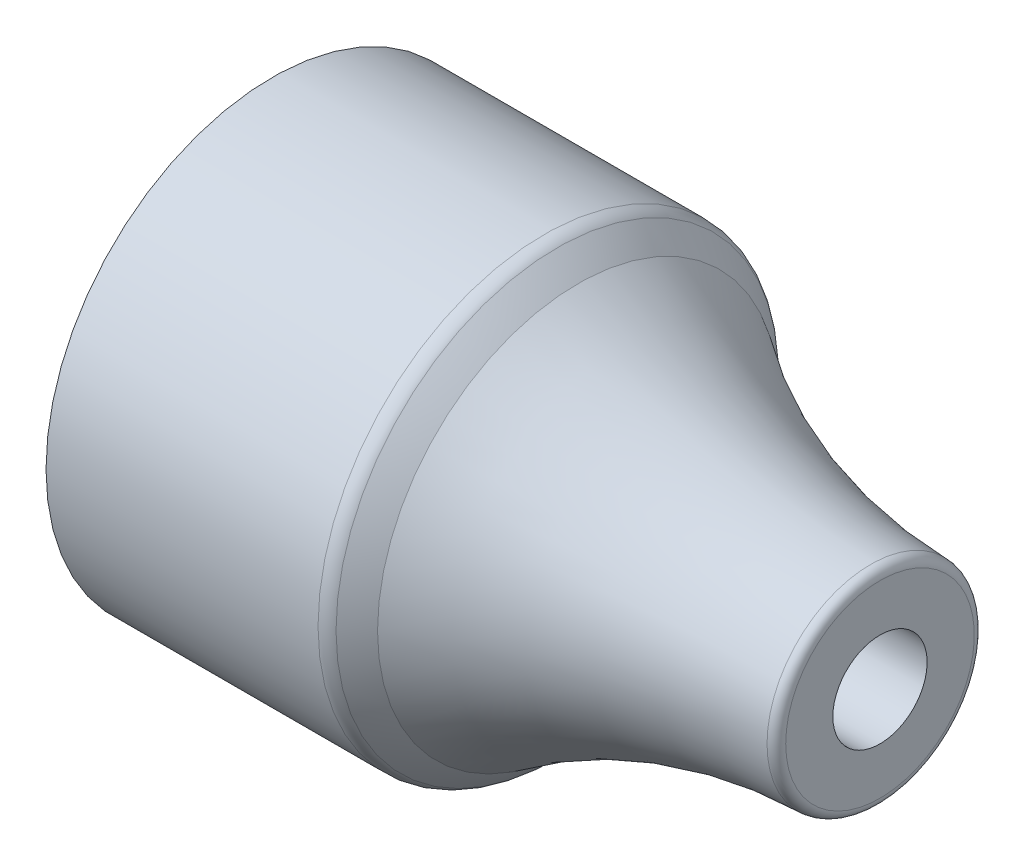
ISO-10303-21;
HEADER;
FILE_DESCRIPTION(('STEP AP214'),'2;1');
FILE_NAME('part.step','',(''),(''),'','','');
FILE_SCHEMA(('AUTOMOTIVE_DESIGN { 1 0 10303 214 1 1 1 1 }'));
ENDSEC;
DATA;
#1=APPLICATION_CONTEXT('core data for automotive mechanical design processes');
#2=APPLICATION_PROTOCOL_DEFINITION('international standard','automotive_design',2000,#1);
#3=PRODUCT_CONTEXT('',#1,'mechanical');
#4=PRODUCT('Part','Part','',(#3));
#5=PRODUCT_RELATED_PRODUCT_CATEGORY('part','',(#4));
#6=PRODUCT_DEFINITION_FORMATION('','',#4);
#7=PRODUCT_DEFINITION_CONTEXT('part definition',#1,'design');
#8=PRODUCT_DEFINITION('design','',#6,#7);
#9=PRODUCT_DEFINITION_SHAPE('','',#8);
#10=(LENGTH_UNIT() NAMED_UNIT(*) SI_UNIT(.MILLI.,.METRE.));
#11=(NAMED_UNIT(*) PLANE_ANGLE_UNIT() SI_UNIT($,.RADIAN.));
#12=(NAMED_UNIT(*) SI_UNIT($,.STERADIAN.) SOLID_ANGLE_UNIT());
#13=UNCERTAINTY_MEASURE_WITH_UNIT(LENGTH_MEASURE(1.E-05),#10,'distance_accuracy_value','');
#14=(GEOMETRIC_REPRESENTATION_CONTEXT(3) GLOBAL_UNCERTAINTY_ASSIGNED_CONTEXT((#13)) GLOBAL_UNIT_ASSIGNED_CONTEXT((#10,
#11,#12)) REPRESENTATION_CONTEXT('',''));
#15=CARTESIAN_POINT('',(0.,0.,0.));
#16=DIRECTION('',(0.,0.,1.));
#17=DIRECTION('',(1.,0.,0.));
#18=AXIS2_PLACEMENT_3D('',#15,#16,#17);
#19=CARTESIAN_POINT('',(-1.,6.,0.));
#20=DIRECTION('',(1.,0.,0.));
#21=DIRECTION('',(0.,0.,-1.));
#22=AXIS2_PLACEMENT_3D('',#19,#20,#21);
#23=PLANE('',#22);
#24=CARTESIAN_POINT('',(-1.,0.,0.));
#25=DIRECTION('',(-1.,0.,0.));
#26=DIRECTION('',(0.,0.,1.));
#27=AXIS2_PLACEMENT_3D('',#24,#25,#26);
#28=CIRCLE('',#27,6.);
#29=CARTESIAN_POINT('',(-1.,0.,6.));
#30=VERTEX_POINT('',#29);
#31=EDGE_CURVE('E78',#30,#30,#28,.T.);
#32=ORIENTED_EDGE('',*,*,#31,.T.);
#33=EDGE_LOOP('',(#32));
#34=FACE_BOUND('',#33,.T.);
#35=CARTESIAN_POINT('',(-1.,0.,0.));
#36=DIRECTION('',(1.,0.,0.));
#37=DIRECTION('',(0.,0.,-1.));
#38=AXIS2_PLACEMENT_3D('',#35,#36,#37);
#39=CIRCLE('',#38,4.);
#40=CARTESIAN_POINT('',(-1.,0.,-4.));
#41=VERTEX_POINT('',#40);
#42=EDGE_CURVE('E10',#41,#41,#39,.F.);
#43=ORIENTED_EDGE('',*,*,#42,.F.);
#44=EDGE_LOOP('',(#43));
#45=FACE_BOUND('',#44,.T.);
#46=ADVANCED_FACE('F34',(#34,#45),#23,.F.);
#47=CARTESIAN_POINT('',(-25.6027488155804,0.,0.));
#48=DIRECTION('',(-1.,0.,0.));
#49=DIRECTION('',(0.,0.,1.));
#50=AXIS2_PLACEMENT_3D('',#47,#48,#49);
#51=TOROIDAL_SURFACE('',#50,22.,2.);
#52=CARTESIAN_POINT('',(-25.6027488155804,0.,0.));
#53=DIRECTION('',(-1.,0.,0.));
#54=DIRECTION('',(0.,0.,1.));
#55=AXIS2_PLACEMENT_3D('',#52,#53,#54);
#56=CIRCLE('',#55,24.);
#57=CARTESIAN_POINT('',(-25.6027488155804,0.,24.));
#58=VERTEX_POINT('',#57);
#59=EDGE_CURVE('E41',#58,#58,#56,.T.);
#60=ORIENTED_EDGE('',*,*,#59,.F.);
#61=EDGE_LOOP('',(#60));
#62=FACE_BOUND('',#61,.T.);
#63=CARTESIAN_POINT('',(-24.235336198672,0.,0.));
#64=DIRECTION('',(-1.,0.,0.));
#65=DIRECTION('',(0.,0.,1.));
#66=AXIS2_PLACEMENT_3D('',#63,#64,#65);
#67=CIRCLE('',#66,23.4595145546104);
#68=CARTESIAN_POINT('',(-24.235336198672,0.,23.4595145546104));
#69=VERTEX_POINT('',#68);
#70=EDGE_CURVE('E96',#69,#69,#67,.T.);
#71=ORIENTED_EDGE('',*,*,#70,.T.);
#72=EDGE_LOOP('',(#71));
#73=FACE_BOUND('',#72,.T.);
#74=ADVANCED_FACE('F36',(#62,#73),#51,.T.);
#75=CARTESIAN_POINT('',(-71.7746086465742,0.,0.));
#76=DIRECTION('',(-1.,0.,0.));
#77=DIRECTION('',(0.,0.,1.));
#78=AXIS2_PLACEMENT_3D('',#75,#76,#77);
#79=CYLINDRICAL_SURFACE('',#78,24.);
#80=CARTESIAN_POINT('',(-54.45,0.,0.));
#81=DIRECTION('',(-1.,0.,0.));
#82=DIRECTION('',(0.,0.,1.));
#83=AXIS2_PLACEMENT_3D('',#80,#81,#82);
#84=CIRCLE('',#83,24.);
#85=CARTESIAN_POINT('',(-54.45,0.,24.));
#86=VERTEX_POINT('',#85);
#87=EDGE_CURVE('E45',#86,#86,#84,.T.);
#88=ORIENTED_EDGE('',*,*,#87,.F.);
#89=EDGE_LOOP('',(#88));
#90=FACE_BOUND('',#89,.T.);
#91=ORIENTED_EDGE('',*,*,#59,.T.);
#92=EDGE_LOOP('',(#91));
#93=FACE_BOUND('',#92,.T.);
#94=ADVANCED_FACE('F131',(#90,#93),#79,.T.);
#95=CARTESIAN_POINT('',(-54.45,24.,0.));
#96=DIRECTION('',(1.,0.,0.));
#97=DIRECTION('',(0.,0.,-1.));
#98=AXIS2_PLACEMENT_3D('',#95,#96,#97);
#99=PLANE('',#98);
#100=CARTESIAN_POINT('',(-54.45,0.,0.));
#101=DIRECTION('',(-1.,0.,0.));
#102=DIRECTION('',(0.,0.,1.));
#103=AXIS2_PLACEMENT_3D('',#100,#101,#102);
#104=CIRCLE('',#103,23.5);
#105=CARTESIAN_POINT('',(-54.45,0.,23.5));
#106=VERTEX_POINT('',#105);
#107=EDGE_CURVE('E49',#106,#106,#104,.T.);
#108=ORIENTED_EDGE('',*,*,#107,.F.);
#109=EDGE_LOOP('',(#108));
#110=FACE_BOUND('',#109,.T.);
#111=ORIENTED_EDGE('',*,*,#87,.T.);
#112=EDGE_LOOP('',(#111));
#113=FACE_BOUND('',#112,.T.);
#114=ADVANCED_FACE('F173',(#110,#113),#99,.F.);
#115=CARTESIAN_POINT('',(-71.7746086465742,0.,0.));
#116=DIRECTION('',(-1.,0.,0.));
#117=DIRECTION('',(0.,0.,1.));
#118=AXIS2_PLACEMENT_3D('',#115,#116,#117);
#119=CYLINDRICAL_SURFACE('',#118,23.5);
#120=CARTESIAN_POINT('',(-51.45,0.,0.));
#121=DIRECTION('',(-1.,0.,0.));
#122=DIRECTION('',(0.,0.,1.));
#123=AXIS2_PLACEMENT_3D('',#120,#121,#122);
#124=CIRCLE('',#123,23.5);
#125=CARTESIAN_POINT('',(-51.45,0.,23.5));
#126=VERTEX_POINT('',#125);
#127=EDGE_CURVE('E54',#126,#126,#124,.T.);
#128=ORIENTED_EDGE('',*,*,#127,.F.);
#129=EDGE_LOOP('',(#128));
#130=FACE_BOUND('',#129,.T.);
#131=ORIENTED_EDGE('',*,*,#107,.T.);
#132=EDGE_LOOP('',(#131));
#133=FACE_BOUND('',#132,.T.);
#134=ADVANCED_FACE('F169',(#130,#133),#119,.F.);
#135=CARTESIAN_POINT('',(-51.45,23.5,0.));
#136=DIRECTION('',(1.,0.,0.));
#137=DIRECTION('',(0.,0.,-1.));
#138=AXIS2_PLACEMENT_3D('',#135,#136,#137);
#139=PLANE('',#138);
#140=CARTESIAN_POINT('',(-51.45,0.,0.));
#141=DIRECTION('',(-1.,0.,0.));
#142=DIRECTION('',(0.,0.,1.));
#143=AXIS2_PLACEMENT_3D('',#140,#141,#142);
#144=CIRCLE('',#143,23.);
#145=CARTESIAN_POINT('',(-51.45,0.,23.));
#146=VERTEX_POINT('',#145);
#147=EDGE_CURVE('E57',#146,#146,#144,.T.);
#148=ORIENTED_EDGE('',*,*,#147,.F.);
#149=EDGE_LOOP('',(#148));
#150=FACE_BOUND('',#149,.T.);
#151=ORIENTED_EDGE('',*,*,#127,.T.);
#152=EDGE_LOOP('',(#151));
#153=FACE_BOUND('',#152,.T.);
#154=ADVANCED_FACE('F165',(#150,#153),#139,.F.);
#155=CARTESIAN_POINT('',(-71.7746086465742,0.,0.));
#156=DIRECTION('',(-1.,0.,0.));
#157=DIRECTION('',(0.,0.,1.));
#158=AXIS2_PLACEMENT_3D('',#155,#156,#157);
#159=CYLINDRICAL_SURFACE('',#158,23.);
#160=CARTESIAN_POINT('',(-26.,0.,0.));
#161=DIRECTION('',(-1.,0.,0.));
#162=DIRECTION('',(0.,0.,1.));
#163=AXIS2_PLACEMENT_3D('',#160,#161,#162);
#164=CIRCLE('',#163,23.);
#165=CARTESIAN_POINT('',(-26.,0.,23.));
#166=VERTEX_POINT('',#165);
#167=EDGE_CURVE('E60',#166,#166,#164,.T.);
#168=ORIENTED_EDGE('',*,*,#167,.F.);
#169=EDGE_LOOP('',(#168));
#170=FACE_BOUND('',#169,.T.);
#171=ORIENTED_EDGE('',*,*,#147,.T.);
#172=EDGE_LOOP('',(#171));
#173=FACE_BOUND('',#172,.T.);
#174=ADVANCED_FACE('F161',(#170,#173),#159,.F.);
#175=CARTESIAN_POINT('',(-26.,0.,0.));
#176=DIRECTION('',(-1.,0.,0.));
#177=DIRECTION('',(0.,0.,1.));
#178=AXIS2_PLACEMENT_3D('',#175,#176,#177);
#179=TOROIDAL_SURFACE('',#178,21.,2.);
#180=CARTESIAN_POINT('',(-24.6225363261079,0.,0.));
#181=DIRECTION('',(-1.,0.,0.));
#182=DIRECTION('',(0.,0.,1.));
#183=AXIS2_PLACEMENT_3D('',#180,#181,#182);
#184=CIRCLE('',#183,22.4500323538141);
#185=CARTESIAN_POINT('',(-24.6225363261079,0.,22.4500323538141));
#186=VERTEX_POINT('',#185);
#187=EDGE_CURVE('E63',#186,#186,#184,.T.);
#188=ORIENTED_EDGE('',*,*,#187,.F.);
#189=EDGE_LOOP('',(#188));
#190=FACE_BOUND('',#189,.T.);
#191=ORIENTED_EDGE('',*,*,#167,.T.);
#192=EDGE_LOOP('',(#191));
#193=FACE_BOUND('',#192,.T.);
#194=ADVANCED_FACE('F157',(#190,#193),#179,.F.);
#195=CARTESIAN_POINT('',(-65.2577147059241,0.,0.));
#196=DIRECTION('',(-1.,0.,0.));
#197=DIRECTION('',(0.,0.,1.));
#198=AXIS2_PLACEMENT_3D('',#195,#196,#197);
#199=DEGENERATE_TOROIDAL_SURFACE('',#198,20.3259220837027,59.,.F.);
#200=CARTESIAN_POINT('',(-22.6764290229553,0.,0.));
#201=DIRECTION('',(-1.,0.,0.));
#202=DIRECTION('',(0.,0.,1.));
#203=AXIS2_PLACEMENT_3D('',#200,#201,#202);
#204=CIRCLE('',#203,20.5132026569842);
#205=CARTESIAN_POINT('',(-22.6764290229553,0.,20.5132026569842));
#206=VERTEX_POINT('',#205);
#207=EDGE_CURVE('E66',#206,#206,#204,.T.);
#208=ORIENTED_EDGE('',*,*,#207,.F.);
#209=EDGE_LOOP('',(#208));
#210=FACE_BOUND('',#209,.T.);
#211=ORIENTED_EDGE('',*,*,#187,.T.);
#212=EDGE_LOOP('',(#211));
#213=FACE_BOUND('',#212,.T.);
#214=ADVANCED_FACE('F153',(#210,#213),#199,.T.);
#215=CARTESIAN_POINT('',(10.,0.,0.));
#216=DIRECTION('',(-1.,0.,0.));
#217=DIRECTION('',(0.,0.,1.));
#218=AXIS2_PLACEMENT_3D('',#215,#216,#217);
#219=TOROIDAL_SURFACE('',#218,65.9912301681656,56.);
#220=CARTESIAN_POINT('',(8.03508771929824,0.,0.));
#221=DIRECTION('',(-1.,0.,0.));
#222=DIRECTION('',(0.,0.,1.));
#223=AXIS2_PLACEMENT_3D('',#220,#221,#222);
#224=CIRCLE('',#223,10.0257129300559);
#225=CARTESIAN_POINT('',(8.03508771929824,0.,10.0257129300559));
#226=VERTEX_POINT('',#225);
#227=EDGE_CURVE('E69',#226,#226,#224,.T.);
#228=ORIENTED_EDGE('',*,*,#227,.F.);
#229=EDGE_LOOP('',(#228));
#230=FACE_BOUND('',#229,.T.);
#231=ORIENTED_EDGE('',*,*,#207,.T.);
#232=EDGE_LOOP('',(#231));
#233=FACE_BOUND('',#232,.T.);
#234=ADVANCED_FACE('F149',(#230,#233),#219,.T.);
#235=CARTESIAN_POINT('',(8.,0.,0.));
#236=DIRECTION('',(-1.,0.,0.));
#237=DIRECTION('',(0.,0.,1.));
#238=AXIS2_PLACEMENT_3D('',#235,#236,#237);
#239=TOROIDAL_SURFACE('',#238,9.02632869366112,1.);
#240=CARTESIAN_POINT('',(9.00000000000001,0.,0.));
#241=DIRECTION('',(-1.,0.,0.));
#242=DIRECTION('',(0.,0.,1.));
#243=AXIS2_PLACEMENT_3D('',#240,#241,#242);
#244=CIRCLE('',#243,9.02632869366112);
#245=CARTESIAN_POINT('',(9.00000000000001,0.,9.02632869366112));
#246=VERTEX_POINT('',#245);
#247=EDGE_CURVE('E72',#246,#246,#244,.T.);
#248=ORIENTED_EDGE('',*,*,#247,.F.);
#249=EDGE_LOOP('',(#248));
#250=FACE_BOUND('',#249,.T.);
#251=ORIENTED_EDGE('',*,*,#227,.T.);
#252=EDGE_LOOP('',(#251));
#253=FACE_BOUND('',#252,.T.);
#254=ADVANCED_FACE('F145',(#250,#253),#239,.F.);
#255=CARTESIAN_POINT('',(9.,6.,0.));
#256=DIRECTION('',(1.,0.,0.));
#257=DIRECTION('',(0.,0.,-1.));
#258=AXIS2_PLACEMENT_3D('',#255,#256,#257);
#259=PLANE('',#258);
#260=CARTESIAN_POINT('',(9.00000000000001,0.,0.));
#261=DIRECTION('',(-1.,0.,0.));
#262=DIRECTION('',(0.,0.,1.));
#263=AXIS2_PLACEMENT_3D('',#260,#261,#262);
#264=CIRCLE('',#263,6.);
#265=CARTESIAN_POINT('',(9.00000000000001,0.,6.));
#266=VERTEX_POINT('',#265);
#267=EDGE_CURVE('E75',#266,#266,#264,.T.);
#268=ORIENTED_EDGE('',*,*,#267,.F.);
#269=EDGE_LOOP('',(#268));
#270=FACE_BOUND('',#269,.T.);
#271=ORIENTED_EDGE('',*,*,#247,.T.);
#272=EDGE_LOOP('',(#271));
#273=FACE_BOUND('',#272,.T.);
#274=ADVANCED_FACE('F141',(#270,#273),#259,.F.);
#275=CARTESIAN_POINT('',(-71.7746086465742,0.,0.));
#276=DIRECTION('',(-1.,0.,0.));
#277=DIRECTION('',(0.,0.,1.));
#278=AXIS2_PLACEMENT_3D('',#275,#276,#277);
#279=CYLINDRICAL_SURFACE('',#278,6.);
#280=ORIENTED_EDGE('',*,*,#31,.F.);
#281=EDGE_LOOP('',(#280));
#282=FACE_BOUND('',#281,.T.);
#283=ORIENTED_EDGE('',*,*,#267,.T.);
#284=EDGE_LOOP('',(#283));
#285=FACE_BOUND('',#284,.T.);
#286=ADVANCED_FACE('F138',(#282,#285),#279,.T.);
#287=CARTESIAN_POINT('',(0.,0.,0.));
#288=DIRECTION('',(-1.,0.,0.));
#289=DIRECTION('',(0.,0.,1.));
#290=AXIS2_PLACEMENT_3D('',#287,#288,#289);
#291=PLANE('',#290);
#292=CARTESIAN_POINT('',(0.,0.,0.));
#293=DIRECTION('',(1.,0.,0.));
#294=DIRECTION('',(0.,0.,-1.));
#295=AXIS2_PLACEMENT_3D('',#292,#293,#294);
#296=CIRCLE('',#295,3.);
#297=CARTESIAN_POINT('',(0.,0.,-3.));
#298=VERTEX_POINT('',#297);
#299=EDGE_CURVE('E99',#298,#298,#296,.T.);
#300=ORIENTED_EDGE('',*,*,#299,.F.);
#301=EDGE_LOOP('',(#300));
#302=FACE_BOUND('',#301,.T.);
#303=CARTESIAN_POINT('',(0.,0.,0.));
#304=DIRECTION('',(-1.,0.,0.));
#305=DIRECTION('',(0.,0.,1.));
#306=AXIS2_PLACEMENT_3D('',#303,#304,#305);
#307=CIRCLE('',#306,5.);
#308=CARTESIAN_POINT('',(0.,0.,5.));
#309=VERTEX_POINT('',#308);
#310=EDGE_CURVE('E81',#309,#309,#307,.T.);
#311=ORIENTED_EDGE('',*,*,#310,.F.);
#312=EDGE_LOOP('',(#311));
#313=FACE_BOUND('',#312,.T.);
#314=ADVANCED_FACE('F136',(#302,#313),#291,.F.);
#315=CARTESIAN_POINT('',(-71.7746086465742,0.,0.));
#316=DIRECTION('',(-1.,0.,0.));
#317=DIRECTION('',(0.,0.,1.));
#318=AXIS2_PLACEMENT_3D('',#315,#316,#317);
#319=CYLINDRICAL_SURFACE('',#318,5.);
#320=CARTESIAN_POINT('',(9.99999999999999,0.,0.));
#321=DIRECTION('',(-1.,0.,0.));
#322=DIRECTION('',(0.,0.,1.));
#323=AXIS2_PLACEMENT_3D('',#320,#321,#322);
#324=CIRCLE('',#323,5.);
#325=CARTESIAN_POINT('',(9.99999999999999,0.,5.));
#326=VERTEX_POINT('',#325);
#327=EDGE_CURVE('E84',#326,#326,#324,.T.);
#328=ORIENTED_EDGE('',*,*,#327,.F.);
#329=EDGE_LOOP('',(#328));
#330=FACE_BOUND('',#329,.T.);
#331=ORIENTED_EDGE('',*,*,#310,.T.);
#332=EDGE_LOOP('',(#331));
#333=FACE_BOUND('',#332,.T.);
#334=ADVANCED_FACE('F233',(#330,#333),#319,.F.);
#335=CARTESIAN_POINT('',(10.,5.,0.));
#336=DIRECTION('',(-1.,0.,0.));
#337=DIRECTION('',(0.,0.,1.));
#338=AXIS2_PLACEMENT_3D('',#335,#336,#337);
#339=PLANE('',#338);
#340=CARTESIAN_POINT('',(10.,0.,0.));
#341=DIRECTION('',(-1.,0.,0.));
#342=DIRECTION('',(0.,0.,1.));
#343=AXIS2_PLACEMENT_3D('',#340,#341,#342);
#344=CIRCLE('',#343,10.0001594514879);
#345=CARTESIAN_POINT('',(10.,0.,10.0001594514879));
#346=VERTEX_POINT('',#345);
#347=EDGE_CURVE('E87',#346,#346,#344,.T.);
#348=ORIENTED_EDGE('',*,*,#347,.F.);
#349=EDGE_LOOP('',(#348));
#350=FACE_BOUND('',#349,.T.);
#351=ORIENTED_EDGE('',*,*,#327,.T.);
#352=EDGE_LOOP('',(#351));
#353=FACE_BOUND('',#352,.T.);
#354=ADVANCED_FACE('F240',(#350,#353),#339,.F.);
#355=CARTESIAN_POINT('',(9.,0.,0.));
#356=DIRECTION('',(-1.,0.,0.));
#357=DIRECTION('',(0.,0.,1.));
#358=AXIS2_PLACEMENT_3D('',#355,#356,#357);
#359=TOROIDAL_SURFACE('',#358,10.0001594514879,1.);
#360=CARTESIAN_POINT('',(9.01785714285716,0.,0.));
#361=DIRECTION('',(-1.,0.,0.));
#362=DIRECTION('',(0.,0.,1.));
#363=AXIS2_PLACEMENT_3D('',#360,#361,#362);
#364=CIRCLE('',#363,11.);
#365=CARTESIAN_POINT('',(9.01785714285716,0.,11.));
#366=VERTEX_POINT('',#365);
#367=EDGE_CURVE('E90',#366,#366,#364,.T.);
#368=ORIENTED_EDGE('',*,*,#367,.F.);
#369=EDGE_LOOP('',(#368));
#370=FACE_BOUND('',#369,.T.);
#371=ORIENTED_EDGE('',*,*,#347,.T.);
#372=EDGE_LOOP('',(#371));
#373=FACE_BOUND('',#372,.T.);
#374=ADVANCED_FACE('F247',(#370,#373),#359,.T.);
#375=CARTESIAN_POINT('',(10.,0.,0.));
#376=DIRECTION('',(-1.,0.,0.));
#377=DIRECTION('',(0.,0.,1.));
#378=AXIS2_PLACEMENT_3D('',#375,#376,#377);
#379=TOROIDAL_SURFACE('',#378,65.9912301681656,55.);
#380=CARTESIAN_POINT('',(-22.0189134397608,0.,0.));
#381=DIRECTION('',(-1.,0.,0.));
#382=DIRECTION('',(0.,0.,1.));
#383=AXIS2_PLACEMENT_3D('',#380,#381,#382);
#384=CIRCLE('',#383,21.2722276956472);
#385=CARTESIAN_POINT('',(-22.0189134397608,0.,21.2722276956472));
#386=VERTEX_POINT('',#385);
#387=EDGE_CURVE('E93',#386,#386,#384,.T.);
#388=ORIENTED_EDGE('',*,*,#387,.F.);
#389=EDGE_LOOP('',(#388));
#390=FACE_BOUND('',#389,.T.);
#391=ORIENTED_EDGE('',*,*,#367,.T.);
#392=EDGE_LOOP('',(#391));
#393=FACE_BOUND('',#392,.T.);
#394=ADVANCED_FACE('F255',(#390,#393),#379,.F.);
#395=CARTESIAN_POINT('',(-65.2577147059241,0.,0.));
#396=DIRECTION('',(-1.,0.,0.));
#397=DIRECTION('',(0.,0.,1.));
#398=AXIS2_PLACEMENT_3D('',#395,#396,#397);
#399=DEGENERATE_TOROIDAL_SURFACE('',#398,20.3259220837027,60.,.F.);
#400=ORIENTED_EDGE('',*,*,#70,.F.);
#401=EDGE_LOOP('',(#400));
#402=FACE_BOUND('',#401,.T.);
#403=ORIENTED_EDGE('',*,*,#387,.T.);
#404=EDGE_LOOP('',(#403));
#405=FACE_BOUND('',#404,.T.);
#406=ADVANCED_FACE('F122',(#402,#405),#399,.F.);
#407=CARTESIAN_POINT('',(-15.,0.,0.));
#408=DIRECTION('',(1.,0.,0.));
#409=DIRECTION('',(0.,0.,-1.));
#410=AXIS2_PLACEMENT_3D('',#407,#408,#409);
#411=CYLINDRICAL_SURFACE('',#410,3.);
#412=ORIENTED_EDGE('',*,*,#299,.T.);
#413=EDGE_LOOP('',(#412));
#414=FACE_BOUND('',#413,.T.);
#415=CARTESIAN_POINT('',(-11.,0.,0.));
#416=DIRECTION('',(-1.,0.,0.));
#417=DIRECTION('',(0.,0.,1.));
#418=AXIS2_PLACEMENT_3D('',#415,#416,#417);
#419=CIRCLE('',#418,3.);
#420=CARTESIAN_POINT('',(-11.,0.,3.));
#421=VERTEX_POINT('',#420);
#422=EDGE_CURVE('E105',#421,#421,#419,.T.);
#423=ORIENTED_EDGE('',*,*,#422,.T.);
#424=EDGE_LOOP('',(#423));
#425=FACE_BOUND('',#424,.T.);
#426=ADVANCED_FACE('F109',(#414,#425),#411,.F.);
#427=CARTESIAN_POINT('',(-11.,0.,0.));
#428=DIRECTION('',(-1.,0.,0.));
#429=DIRECTION('',(0.,0.,1.));
#430=AXIS2_PLACEMENT_3D('',#427,#428,#429);
#431=PLANE('',#430);
#432=CARTESIAN_POINT('',(-11.,0.,0.));
#433=DIRECTION('',(-1.,0.,0.));
#434=DIRECTION('',(0.,0.,1.));
#435=AXIS2_PLACEMENT_3D('',#432,#433,#434);
#436=CIRCLE('',#435,4.);
#437=CARTESIAN_POINT('',(-11.,0.,4.));
#438=VERTEX_POINT('',#437);
#439=EDGE_CURVE('E102',#438,#438,#436,.T.);
#440=ORIENTED_EDGE('',*,*,#439,.T.);
#441=EDGE_LOOP('',(#440));
#442=FACE_BOUND('',#441,.T.);
#443=ORIENTED_EDGE('',*,*,#422,.F.);
#444=EDGE_LOOP('',(#443));
#445=FACE_BOUND('',#444,.T.);
#446=ADVANCED_FACE('F111',(#442,#445),#431,.T.);
#447=CARTESIAN_POINT('',(-11.,0.,0.));
#448=DIRECTION('',(1.,0.,0.));
#449=DIRECTION('',(0.,0.,-1.));
#450=AXIS2_PLACEMENT_3D('',#447,#448,#449);
#451=CYLINDRICAL_SURFACE('',#450,4.);
#452=ORIENTED_EDGE('',*,*,#439,.F.);
#453=EDGE_LOOP('',(#452));
#454=FACE_BOUND('',#453,.T.);
#455=ORIENTED_EDGE('',*,*,#42,.T.);
#456=EDGE_LOOP('',(#455));
#457=FACE_BOUND('',#456,.T.);
#458=ADVANCED_FACE('F113',(#454,#457),#451,.T.);
#459=CLOSED_SHELL('',(#46,#74,#94,#114,#134,#154,#174,#194,#214,#234,#254,#274,#286,#314,#334,
#354,#374,#394,#406,#426,#446,#458));
#460=MANIFOLD_SOLID_BREP('B2',#459);
#461=ADVANCED_BREP_SHAPE_REPRESENTATION('',(#18,#460),#14);
#462=SHAPE_DEFINITION_REPRESENTATION(#9,#461);
ENDSEC;
END-ISO-10303-21;
